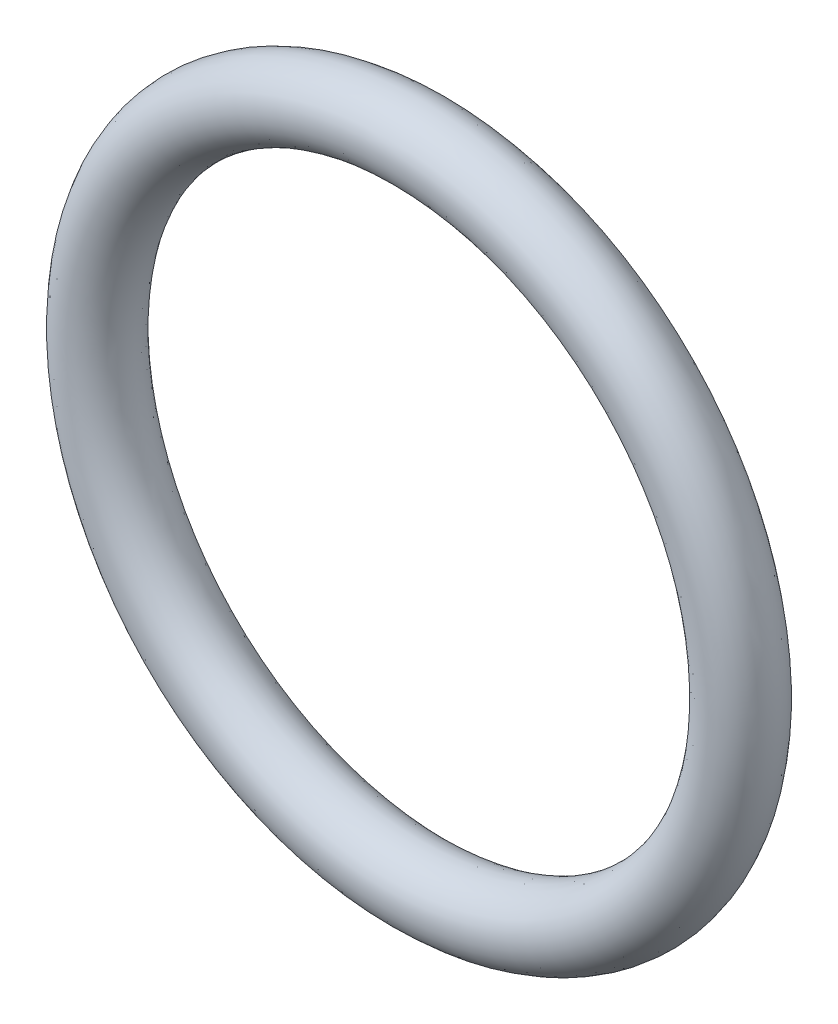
ISO-10303-21;
HEADER;
FILE_DESCRIPTION(('STEP AP214'),'2;1');
FILE_NAME('part.step','',(''),(''),'','','');
FILE_SCHEMA(('AUTOMOTIVE_DESIGN { 1 0 10303 214 1 1 1 1 }'));
ENDSEC;
DATA;
#1=APPLICATION_CONTEXT('core data for automotive mechanical design processes');
#2=APPLICATION_PROTOCOL_DEFINITION('international standard','automotive_design',2000,#1);
#3=PRODUCT_CONTEXT('',#1,'mechanical');
#4=PRODUCT('Part','Part','',(#3));
#5=PRODUCT_RELATED_PRODUCT_CATEGORY('part','',(#4));
#6=PRODUCT_DEFINITION_FORMATION('','',#4);
#7=PRODUCT_DEFINITION_CONTEXT('part definition',#1,'design');
#8=PRODUCT_DEFINITION('design','',#6,#7);
#9=PRODUCT_DEFINITION_SHAPE('','',#8);
#10=(LENGTH_UNIT() NAMED_UNIT(*) SI_UNIT(.MILLI.,.METRE.));
#11=(NAMED_UNIT(*) PLANE_ANGLE_UNIT() SI_UNIT($,.RADIAN.));
#12=(NAMED_UNIT(*) SI_UNIT($,.STERADIAN.) SOLID_ANGLE_UNIT());
#13=UNCERTAINTY_MEASURE_WITH_UNIT(LENGTH_MEASURE(1.E-05),#10,'distance_accuracy_value','');
#14=(GEOMETRIC_REPRESENTATION_CONTEXT(3) GLOBAL_UNCERTAINTY_ASSIGNED_CONTEXT((#13)) GLOBAL_UNIT_ASSIGNED_CONTEXT((#10,
#11,#12)) REPRESENTATION_CONTEXT('',''));
#15=CARTESIAN_POINT('',(0.,0.,0.));
#16=DIRECTION('',(0.,0.,1.));
#17=DIRECTION('',(1.,0.,0.));
#18=AXIS2_PLACEMENT_3D('',#15,#16,#17);
#19=CARTESIAN_POINT('',(0.,14.075,-1.575));
#20=DIRECTION('',(1.,0.,0.));
#21=DIRECTION('',(0.,1.,0.));
#22=AXIS2_PLACEMENT_3D('',#19,#20,#21);
#23=ELLIPSE('',#22,1.575,1.575);
#24=CARTESIAN_POINT('',(0.,0.,0.));
#25=DIRECTION('',(0.,0.,1.));
#26=AXIS1_PLACEMENT('',#24,#25);
#27=SURFACE_OF_REVOLUTION('',#23,#26);
#28=ADVANCED_FACE('F26',(),#27,.T.);
#29=CLOSED_SHELL('',(#28));
#30=MANIFOLD_SOLID_BREP('B2',#29);
#31=ADVANCED_BREP_SHAPE_REPRESENTATION('',(#18,#30),#14);
#32=SHAPE_DEFINITION_REPRESENTATION(#9,#31);
ENDSEC;
END-ISO-10303-21;
